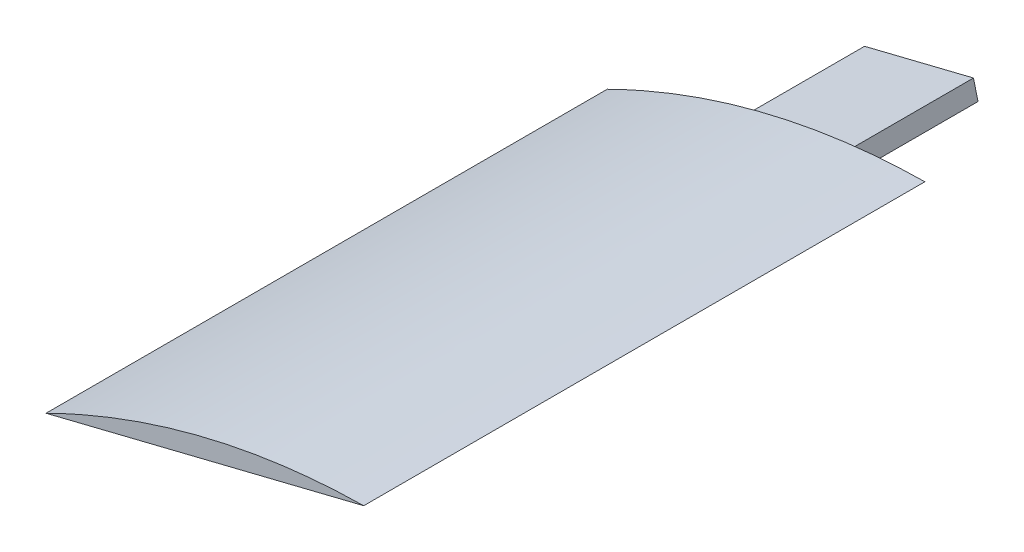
from build123d import *

# Parameters (mm, degrees)
SALIENTE_EXTRUIR1_DEPTH = 300
SALIENTE_EXTRUIR2_DEPTH = 10


with BuildPart() as part:
    # Croquis1 → Saliente-Extruir1 (new body)
    with BuildSketch(Plane.XY):
        with BuildLine():
            Line((0, 0), (169.859110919, 42.105610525))
            add(Edge.make_bspline(
                [(0, 0), (82.512821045, 40.846672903), (169.859110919, 42.105610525)],
                knots=[0, 0, 0, 0.940200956, 0.940200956, 0.940200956], degree=2))
        make_face()
    extrude(amount=SALIENTE_EXTRUIR1_DEPTH)

    # Croquis4 → Saliente-Extruir2 (add)
    with BuildSketch(Plane(origin=(0, 0, 0), x_dir=(0.9706234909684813, 0.24060348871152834, 0), z_dir=(0.2406034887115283, -0.9706234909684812, 0))):
        Polygon((66.992939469, 67.431769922), (66.992939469, -72.568230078), (126.992939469, -72.568230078), (126.992939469, 67.431769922), (96.992939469, 67.431769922), align=None)
    extrude(amount=SALIENTE_EXTRUIR2_DEPTH)


solid = part.part
